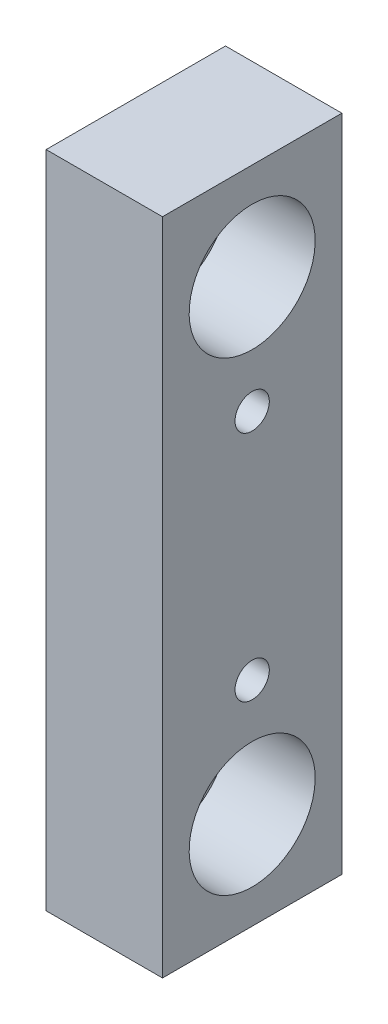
ISO-10303-21;
HEADER;
FILE_DESCRIPTION(('STEP AP214'),'2;1');
FILE_NAME('part.step','',(''),(''),'','','');
FILE_SCHEMA(('AUTOMOTIVE_DESIGN { 1 0 10303 214 1 1 1 1 }'));
ENDSEC;
DATA;
#1=APPLICATION_CONTEXT('core data for automotive mechanical design processes');
#2=APPLICATION_PROTOCOL_DEFINITION('international standard','automotive_design',2000,#1);
#3=PRODUCT_CONTEXT('',#1,'mechanical');
#4=PRODUCT('Part','Part','',(#3));
#5=PRODUCT_RELATED_PRODUCT_CATEGORY('part','',(#4));
#6=PRODUCT_DEFINITION_FORMATION('','',#4);
#7=PRODUCT_DEFINITION_CONTEXT('part definition',#1,'design');
#8=PRODUCT_DEFINITION('design','',#6,#7);
#9=PRODUCT_DEFINITION_SHAPE('','',#8);
#10=(LENGTH_UNIT() NAMED_UNIT(*) SI_UNIT(.MILLI.,.METRE.));
#11=(NAMED_UNIT(*) PLANE_ANGLE_UNIT() SI_UNIT($,.RADIAN.));
#12=(NAMED_UNIT(*) SI_UNIT($,.STERADIAN.) SOLID_ANGLE_UNIT());
#13=UNCERTAINTY_MEASURE_WITH_UNIT(LENGTH_MEASURE(1.E-05),#10,'distance_accuracy_value','');
#14=(GEOMETRIC_REPRESENTATION_CONTEXT(3) GLOBAL_UNCERTAINTY_ASSIGNED_CONTEXT((#13)) GLOBAL_UNIT_ASSIGNED_CONTEXT((#10,
#11,#12)) REPRESENTATION_CONTEXT('',''));
#15=CARTESIAN_POINT('',(0.,0.,0.));
#16=DIRECTION('',(0.,0.,1.));
#17=DIRECTION('',(1.,0.,0.));
#18=AXIS2_PLACEMENT_3D('',#15,#16,#17);
#19=CARTESIAN_POINT('',(-60.3249999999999,-38.1,4.36562500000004));
#20=DIRECTION('',(-1.,0.,0.));
#21=DIRECTION('',(0.,-1.,0.));
#22=AXIS2_PLACEMENT_3D('',#19,#20,#21);
#23=CYLINDRICAL_SURFACE('',#22,5.1562);
#24=CARTESIAN_POINT('',(-101.6,-38.1,4.36562500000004));
#25=DIRECTION('',(-1.,0.,0.));
#26=DIRECTION('',(0.,-1.,0.));
#27=AXIS2_PLACEMENT_3D('',#24,#25,#26);
#28=CIRCLE('',#27,5.1562);
#29=CARTESIAN_POINT('',(-101.6,-43.2562,4.36562500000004));
#30=VERTEX_POINT('',#29);
#31=EDGE_CURVE('E12',#30,#30,#28,.T.);
#32=ORIENTED_EDGE('',*,*,#31,.T.);
#33=EDGE_LOOP('',(#32));
#34=FACE_BOUND('',#33,.T.);
#35=CARTESIAN_POINT('',(-96.8375,-38.1,4.36562500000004));
#36=DIRECTION('',(1.,0.,0.));
#37=DIRECTION('',(0.,1.,0.));
#38=AXIS2_PLACEMENT_3D('',#35,#36,#37);
#39=CIRCLE('',#38,5.1562);
#40=CARTESIAN_POINT('',(-96.8375,-32.9438,4.36562500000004));
#41=VERTEX_POINT('',#40);
#42=EDGE_CURVE('E45',#41,#41,#39,.F.);
#43=ORIENTED_EDGE('',*,*,#42,.F.);
#44=EDGE_LOOP('',(#43));
#45=FACE_BOUND('',#44,.T.);
#46=ADVANCED_FACE('F41',(#34,#45),#23,.F.);
#47=CARTESIAN_POINT('',(-60.325,38.1,4.36562500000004));
#48=DIRECTION('',(-1.,0.,0.));
#49=DIRECTION('',(0.,-1.,0.));
#50=AXIS2_PLACEMENT_3D('',#47,#48,#49);
#51=CYLINDRICAL_SURFACE('',#50,5.1562);
#52=CARTESIAN_POINT('',(-101.6,38.1,4.36562500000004));
#53=DIRECTION('',(-1.,0.,0.));
#54=DIRECTION('',(0.,-1.,0.));
#55=AXIS2_PLACEMENT_3D('',#52,#53,#54);
#56=CIRCLE('',#55,5.1562);
#57=CARTESIAN_POINT('',(-101.6,32.9438,4.36562500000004));
#58=VERTEX_POINT('',#57);
#59=EDGE_CURVE('E50',#58,#58,#56,.T.);
#60=ORIENTED_EDGE('',*,*,#59,.T.);
#61=EDGE_LOOP('',(#60));
#62=FACE_BOUND('',#61,.T.);
#63=CARTESIAN_POINT('',(-96.8375,38.1,4.36562500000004));
#64=DIRECTION('',(1.,0.,0.));
#65=DIRECTION('',(0.,1.,0.));
#66=AXIS2_PLACEMENT_3D('',#63,#64,#65);
#67=CIRCLE('',#66,5.1562);
#68=CARTESIAN_POINT('',(-96.8375,43.2562,4.36562500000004));
#69=VERTEX_POINT('',#68);
#70=EDGE_CURVE('E136',#69,#69,#67,.F.);
#71=ORIENTED_EDGE('',*,*,#70,.F.);
#72=EDGE_LOOP('',(#71));
#73=FACE_BOUND('',#72,.T.);
#74=ADVANCED_FACE('F143',(#62,#73),#51,.F.);
#75=CARTESIAN_POINT('',(-101.6,50.7999999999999,-19.05));
#76=DIRECTION('',(-1.,0.,0.));
#77=DIRECTION('',(0.,-1.,0.));
#78=AXIS2_PLACEMENT_3D('',#75,#76,#77);
#79=PLANE('',#78);
#80=CARTESIAN_POINT('',(-101.6,19.05,4.36562500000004));
#81=DIRECTION('',(-1.,0.,0.));
#82=DIRECTION('',(0.,0.,1.));
#83=AXIS2_PLACEMENT_3D('',#80,#81,#82);
#84=CIRCLE('',#83,4.7625);
#85=CARTESIAN_POINT('',(-101.6,19.05,9.12812500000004));
#86=VERTEX_POINT('',#85);
#87=EDGE_CURVE('E216',#86,#86,#84,.T.);
#88=ORIENTED_EDGE('',*,*,#87,.F.);
#89=EDGE_LOOP('',(#88));
#90=FACE_BOUND('',#89,.T.);
#91=CARTESIAN_POINT('',(-101.6,-19.05,4.36562500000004));
#92=DIRECTION('',(-1.,0.,0.));
#93=DIRECTION('',(0.,0.,1.));
#94=AXIS2_PLACEMENT_3D('',#91,#92,#93);
#95=CIRCLE('',#94,4.7625);
#96=CARTESIAN_POINT('',(-101.6,-19.05,9.12812500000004));
#97=VERTEX_POINT('',#96);
#98=EDGE_CURVE('E226',#97,#97,#95,.T.);
#99=ORIENTED_EDGE('',*,*,#98,.F.);
#100=EDGE_LOOP('',(#99));
#101=FACE_BOUND('',#100,.T.);
#102=ORIENTED_EDGE('',*,*,#59,.F.);
#103=EDGE_LOOP('',(#102));
#104=FACE_BOUND('',#103,.T.);
#105=ORIENTED_EDGE('',*,*,#31,.F.);
#106=EDGE_LOOP('',(#105));
#107=FACE_BOUND('',#106,.T.);
#108=DIRECTION('',(0.,-1.,0.));
#109=VECTOR('',#108,1.);
#110=CARTESIAN_POINT('',(-101.6,50.7999999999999,19.05));
#111=LINE('',#110,#109);
#112=CARTESIAN_POINT('',(-101.6,53.9749999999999,19.05));
#113=VERTEX_POINT('',#112);
#114=CARTESIAN_POINT('',(-101.6,-53.9750000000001,19.05));
#115=VERTEX_POINT('',#114);
#116=EDGE_CURVE('E83',#113,#115,#111,.T.);
#117=ORIENTED_EDGE('',*,*,#116,.F.);
#118=DIRECTION('',(0.,0.,1.));
#119=VECTOR('',#118,1.);
#120=CARTESIAN_POINT('',(-101.6,53.975,-10.3187499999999));
#121=LINE('',#120,#119);
#122=CARTESIAN_POINT('',(-101.6,53.975,-10.3187499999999));
#123=VERTEX_POINT('',#122);
#124=EDGE_CURVE('E117',#123,#113,#121,.T.);
#125=ORIENTED_EDGE('',*,*,#124,.F.);
#126=DIRECTION('',(0.,1.,0.));
#127=VECTOR('',#126,1.);
#128=CARTESIAN_POINT('',(-101.6,-50.8,-10.31875));
#129=LINE('',#128,#127);
#130=CARTESIAN_POINT('',(-101.6,-53.975,-10.31875));
#131=VERTEX_POINT('',#130);
#132=EDGE_CURVE('E96',#131,#123,#129,.T.);
#133=ORIENTED_EDGE('',*,*,#132,.F.);
#134=DIRECTION('',(0.,0.,-1.));
#135=VECTOR('',#134,1.);
#136=CARTESIAN_POINT('',(-101.6,-53.9750000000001,19.05));
#137=LINE('',#136,#135);
#138=EDGE_CURVE('E95',#115,#131,#137,.T.);
#139=ORIENTED_EDGE('',*,*,#138,.F.);
#140=EDGE_LOOP('',(#117,#125,#133,#139));
#141=FACE_BOUND('',#140,.T.);
#142=ADVANCED_FACE('F43',(#90,#101,#104,#107,#141),#79,.T.);
#143=CARTESIAN_POINT('',(-96.8375,38.1,4.36562500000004));
#144=DIRECTION('',(1.,0.,0.));
#145=DIRECTION('',(0.,1.,0.));
#146=AXIS2_PLACEMENT_3D('',#143,#144,#145);
#147=PLANE('',#146);
#148=CARTESIAN_POINT('',(-96.8375,38.1,4.36562500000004));
#149=DIRECTION('',(1.,0.,0.));
#150=DIRECTION('',(0.,1.,0.));
#151=AXIS2_PLACEMENT_3D('',#148,#149,#150);
#152=CIRCLE('',#151,10.31875);
#153=CARTESIAN_POINT('',(-96.8375,48.41875,4.36562500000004));
#154=VERTEX_POINT('',#153);
#155=EDGE_CURVE('E133',#154,#154,#152,.T.);
#156=ORIENTED_EDGE('',*,*,#155,.T.);
#157=EDGE_LOOP('',(#156));
#158=FACE_BOUND('',#157,.T.);
#159=ORIENTED_EDGE('',*,*,#70,.T.);
#160=EDGE_LOOP('',(#159));
#161=FACE_BOUND('',#160,.T.);
#162=ADVANCED_FACE('F141',(#158,#161),#147,.T.);
#163=CARTESIAN_POINT('',(-96.8375,38.1,4.36562500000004));
#164=DIRECTION('',(1.,0.,0.));
#165=DIRECTION('',(0.,1.,0.));
#166=AXIS2_PLACEMENT_3D('',#163,#164,#165);
#167=CYLINDRICAL_SURFACE('',#166,10.31875);
#168=ORIENTED_EDGE('',*,*,#155,.F.);
#169=EDGE_LOOP('',(#168));
#170=FACE_BOUND('',#169,.T.);
#171=CARTESIAN_POINT('',(-82.55,38.1,4.36562500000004));
#172=DIRECTION('',(1.,0.,0.));
#173=DIRECTION('',(0.,1.,0.));
#174=AXIS2_PLACEMENT_3D('',#171,#172,#173);
#175=CIRCLE('',#174,10.31875);
#176=CARTESIAN_POINT('',(-82.55,48.41875,4.36562500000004));
#177=VERTEX_POINT('',#176);
#178=EDGE_CURVE('E127',#177,#177,#175,.T.);
#179=ORIENTED_EDGE('',*,*,#178,.T.);
#180=EDGE_LOOP('',(#179));
#181=FACE_BOUND('',#180,.T.);
#182=ADVANCED_FACE('F154',(#170,#181),#167,.F.);
#183=CARTESIAN_POINT('',(-96.8375,-38.1,4.36562500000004));
#184=DIRECTION('',(1.,0.,0.));
#185=DIRECTION('',(0.,1.,0.));
#186=AXIS2_PLACEMENT_3D('',#183,#184,#185);
#187=PLANE('',#186);
#188=CARTESIAN_POINT('',(-96.8375,-38.1,4.36562500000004));
#189=DIRECTION('',(1.,0.,0.));
#190=DIRECTION('',(0.,1.,0.));
#191=AXIS2_PLACEMENT_3D('',#188,#189,#190);
#192=CIRCLE('',#191,10.31875);
#193=CARTESIAN_POINT('',(-96.8375,-27.78125,4.36562500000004));
#194=VERTEX_POINT('',#193);
#195=EDGE_CURVE('E130',#194,#194,#192,.T.);
#196=ORIENTED_EDGE('',*,*,#195,.T.);
#197=EDGE_LOOP('',(#196));
#198=FACE_BOUND('',#197,.T.);
#199=ORIENTED_EDGE('',*,*,#42,.T.);
#200=EDGE_LOOP('',(#199));
#201=FACE_BOUND('',#200,.T.);
#202=ADVANCED_FACE('F157',(#198,#201),#187,.T.);
#203=CARTESIAN_POINT('',(-96.8375,-38.1,4.36562500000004));
#204=DIRECTION('',(1.,0.,0.));
#205=DIRECTION('',(0.,1.,0.));
#206=AXIS2_PLACEMENT_3D('',#203,#204,#205);
#207=CYLINDRICAL_SURFACE('',#206,10.31875);
#208=ORIENTED_EDGE('',*,*,#195,.F.);
#209=EDGE_LOOP('',(#208));
#210=FACE_BOUND('',#209,.T.);
#211=CARTESIAN_POINT('',(-82.55,-38.1,4.36562500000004));
#212=DIRECTION('',(1.,0.,0.));
#213=DIRECTION('',(0.,1.,0.));
#214=AXIS2_PLACEMENT_3D('',#211,#212,#213);
#215=CIRCLE('',#214,10.31875);
#216=CARTESIAN_POINT('',(-82.55,-27.78125,4.36562500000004));
#217=VERTEX_POINT('',#216);
#218=EDGE_CURVE('E124',#217,#217,#215,.T.);
#219=ORIENTED_EDGE('',*,*,#218,.T.);
#220=EDGE_LOOP('',(#219));
#221=FACE_BOUND('',#220,.T.);
#222=ADVANCED_FACE('F162',(#210,#221),#207,.F.);
#223=CARTESIAN_POINT('',(-82.55,-50.8,15.875));
#224=DIRECTION('',(1.,0.,0.));
#225=DIRECTION('',(0.,1.,0.));
#226=AXIS2_PLACEMENT_3D('',#223,#224,#225);
#227=PLANE('',#226);
#228=CARTESIAN_POINT('',(-82.55,19.05,4.36562500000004));
#229=DIRECTION('',(-1.,0.,0.));
#230=DIRECTION('',(0.,0.,1.));
#231=AXIS2_PLACEMENT_3D('',#228,#229,#230);
#232=CIRCLE('',#231,2.8067);
#233=CARTESIAN_POINT('',(-82.55,19.05,7.17232500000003));
#234=VERTEX_POINT('',#233);
#235=EDGE_CURVE('E223',#234,#234,#232,.T.);
#236=ORIENTED_EDGE('',*,*,#235,.T.);
#237=EDGE_LOOP('',(#236));
#238=FACE_BOUND('',#237,.T.);
#239=CARTESIAN_POINT('',(-82.55,-19.05,4.36562500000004));
#240=DIRECTION('',(-1.,0.,0.));
#241=DIRECTION('',(0.,0.,1.));
#242=AXIS2_PLACEMENT_3D('',#239,#240,#241);
#243=CIRCLE('',#242,2.8067);
#244=CARTESIAN_POINT('',(-82.55,-19.05,7.17232500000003));
#245=VERTEX_POINT('',#244);
#246=EDGE_CURVE('E105',#245,#245,#243,.T.);
#247=ORIENTED_EDGE('',*,*,#246,.T.);
#248=EDGE_LOOP('',(#247));
#249=FACE_BOUND('',#248,.T.);
#250=ORIENTED_EDGE('',*,*,#178,.F.);
#251=EDGE_LOOP('',(#250));
#252=FACE_BOUND('',#251,.T.);
#253=DIRECTION('',(0.,-1.,0.));
#254=VECTOR('',#253,1.);
#255=CARTESIAN_POINT('',(-82.55,50.8,-10.3187499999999));
#256=LINE('',#255,#254);
#257=CARTESIAN_POINT('',(-82.55,53.975,-10.3187499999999));
#258=VERTEX_POINT('',#257);
#259=CARTESIAN_POINT('',(-82.55,-53.975,-10.31875));
#260=VERTEX_POINT('',#259);
#261=EDGE_CURVE('E58',#258,#260,#256,.T.);
#262=ORIENTED_EDGE('',*,*,#261,.F.);
#263=DIRECTION('',(0.,0.,-1.));
#264=VECTOR('',#263,1.);
#265=CARTESIAN_POINT('',(-82.55,53.975,19.05));
#266=LINE('',#265,#264);
#267=CARTESIAN_POINT('',(-82.55,53.975,19.05));
#268=VERTEX_POINT('',#267);
#269=EDGE_CURVE('E92',#268,#258,#266,.T.);
#270=ORIENTED_EDGE('',*,*,#269,.F.);
#271=DIRECTION('',(0.,1.,0.));
#272=VECTOR('',#271,1.);
#273=CARTESIAN_POINT('',(-82.55,-50.8,19.05));
#274=LINE('',#273,#272);
#275=CARTESIAN_POINT('',(-82.55,-53.975,19.05));
#276=VERTEX_POINT('',#275);
#277=EDGE_CURVE('E66',#276,#268,#274,.T.);
#278=ORIENTED_EDGE('',*,*,#277,.F.);
#279=DIRECTION('',(0.,0.,1.));
#280=VECTOR('',#279,1.);
#281=CARTESIAN_POINT('',(-82.55,-53.975,-10.31875));
#282=LINE('',#281,#280);
#283=EDGE_CURVE('E104',#260,#276,#282,.T.);
#284=ORIENTED_EDGE('',*,*,#283,.F.);
#285=EDGE_LOOP('',(#262,#270,#278,#284));
#286=FACE_BOUND('',#285,.T.);
#287=ORIENTED_EDGE('',*,*,#218,.F.);
#288=EDGE_LOOP('',(#287));
#289=FACE_BOUND('',#288,.T.);
#290=ADVANCED_FACE('F165',(#238,#249,#252,#286,#289),#227,.T.);
#291=CARTESIAN_POINT('',(-101.6,50.8,-10.3187499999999));
#292=DIRECTION('',(0.,0.,-1.));
#293=DIRECTION('',(-1.,0.,0.));
#294=AXIS2_PLACEMENT_3D('',#291,#292,#293);
#295=PLANE('',#294);
#296=ORIENTED_EDGE('',*,*,#132,.T.);
#297=DIRECTION('',(-1.,0.,0.));
#298=VECTOR('',#297,1.);
#299=CARTESIAN_POINT('',(-82.55,53.975,-10.3187499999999));
#300=LINE('',#299,#298);
#301=EDGE_CURVE('E114',#258,#123,#300,.T.);
#302=ORIENTED_EDGE('',*,*,#301,.F.);
#303=ORIENTED_EDGE('',*,*,#261,.T.);
#304=DIRECTION('',(1.,0.,0.));
#305=VECTOR('',#304,1.);
#306=CARTESIAN_POINT('',(-101.6,-53.975,-10.31875));
#307=LINE('',#306,#305);
#308=EDGE_CURVE('E100',#131,#260,#307,.T.);
#309=ORIENTED_EDGE('',*,*,#308,.F.);
#310=EDGE_LOOP('',(#296,#302,#303,#309));
#311=FACE_BOUND('',#310,.T.);
#312=ADVANCED_FACE('F172',(#311),#295,.T.);
#313=CARTESIAN_POINT('',(-101.6,-50.8000000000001,19.05));
#314=DIRECTION('',(0.,0.,1.));
#315=DIRECTION('',(1.,0.,0.));
#316=AXIS2_PLACEMENT_3D('',#313,#314,#315);
#317=PLANE('',#316);
#318=ORIENTED_EDGE('',*,*,#116,.T.);
#319=DIRECTION('',(-1.,0.,0.));
#320=VECTOR('',#319,1.);
#321=CARTESIAN_POINT('',(-82.55,-53.975,19.05));
#322=LINE('',#321,#320);
#323=EDGE_CURVE('E87',#276,#115,#322,.T.);
#324=ORIENTED_EDGE('',*,*,#323,.F.);
#325=ORIENTED_EDGE('',*,*,#277,.T.);
#326=DIRECTION('',(1.,0.,0.));
#327=VECTOR('',#326,1.);
#328=CARTESIAN_POINT('',(-101.6,53.9749999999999,19.05));
#329=LINE('',#328,#327);
#330=EDGE_CURVE('E88',#113,#268,#329,.T.);
#331=ORIENTED_EDGE('',*,*,#330,.F.);
#332=EDGE_LOOP('',(#318,#324,#325,#331));
#333=FACE_BOUND('',#332,.T.);
#334=ADVANCED_FACE('F85',(#333),#317,.T.);
#335=CARTESIAN_POINT('',(-101.6,53.975,-10.3187499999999));
#336=DIRECTION('',(0.,1.,0.));
#337=DIRECTION('',(0.,0.,1.));
#338=AXIS2_PLACEMENT_3D('',#335,#336,#337);
#339=PLANE('',#338);
#340=ORIENTED_EDGE('',*,*,#301,.T.);
#341=ORIENTED_EDGE('',*,*,#124,.T.);
#342=ORIENTED_EDGE('',*,*,#330,.T.);
#343=ORIENTED_EDGE('',*,*,#269,.T.);
#344=EDGE_LOOP('',(#340,#341,#342,#343));
#345=FACE_BOUND('',#344,.T.);
#346=ADVANCED_FACE('F179',(#345),#339,.T.);
#347=CARTESIAN_POINT('',(-101.6,-53.9750000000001,19.05));
#348=DIRECTION('',(0.,-1.,0.));
#349=DIRECTION('',(1.,0.,0.));
#350=AXIS2_PLACEMENT_3D('',#347,#348,#349);
#351=PLANE('',#350);
#352=ORIENTED_EDGE('',*,*,#323,.T.);
#353=ORIENTED_EDGE('',*,*,#138,.T.);
#354=ORIENTED_EDGE('',*,*,#308,.T.);
#355=ORIENTED_EDGE('',*,*,#283,.T.);
#356=EDGE_LOOP('',(#352,#353,#354,#355));
#357=FACE_BOUND('',#356,.T.);
#358=ADVANCED_FACE('F103',(#357),#351,.T.);
#359=CARTESIAN_POINT('',(-101.6,-19.05,4.36562500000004));
#360=DIRECTION('',(-1.,0.,0.));
#361=DIRECTION('',(0.,0.,1.));
#362=AXIS2_PLACEMENT_3D('',#359,#360,#361);
#363=CYLINDRICAL_SURFACE('',#362,2.8067);
#364=ORIENTED_EDGE('',*,*,#246,.F.);
#365=EDGE_LOOP('',(#364));
#366=FACE_BOUND('',#365,.T.);
#367=CARTESIAN_POINT('',(-88.9,-19.05,4.36562500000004));
#368=DIRECTION('',(-1.,0.,0.));
#369=DIRECTION('',(0.,0.,1.));
#370=AXIS2_PLACEMENT_3D('',#367,#368,#369);
#371=CIRCLE('',#370,2.8067);
#372=CARTESIAN_POINT('',(-88.9,-19.05,7.17232500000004));
#373=VERTEX_POINT('',#372);
#374=EDGE_CURVE('E108',#373,#373,#371,.T.);
#375=ORIENTED_EDGE('',*,*,#374,.T.);
#376=EDGE_LOOP('',(#375));
#377=FACE_BOUND('',#376,.T.);
#378=ADVANCED_FACE('F185',(#366,#377),#363,.F.);
#379=CARTESIAN_POINT('',(-88.9,-16.2433,4.36562500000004));
#380=DIRECTION('',(1.,0.,0.));
#381=DIRECTION('',(0.,0.,-1.));
#382=AXIS2_PLACEMENT_3D('',#379,#380,#381);
#383=PLANE('',#382);
#384=ORIENTED_EDGE('',*,*,#374,.F.);
#385=EDGE_LOOP('',(#384));
#386=FACE_BOUND('',#385,.T.);
#387=CARTESIAN_POINT('',(-88.9,-19.05,4.36562500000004));
#388=DIRECTION('',(-1.,0.,0.));
#389=DIRECTION('',(0.,0.,1.));
#390=AXIS2_PLACEMENT_3D('',#387,#388,#389);
#391=CIRCLE('',#390,4.7625);
#392=CARTESIAN_POINT('',(-88.9,-19.05,9.12812500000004));
#393=VERTEX_POINT('',#392);
#394=EDGE_CURVE('E229',#393,#393,#391,.T.);
#395=ORIENTED_EDGE('',*,*,#394,.T.);
#396=EDGE_LOOP('',(#395));
#397=FACE_BOUND('',#396,.T.);
#398=ADVANCED_FACE('F188',(#386,#397),#383,.F.);
#399=CARTESIAN_POINT('',(-101.6,-19.05,4.36562500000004));
#400=DIRECTION('',(-1.,0.,0.));
#401=DIRECTION('',(0.,0.,1.));
#402=AXIS2_PLACEMENT_3D('',#399,#400,#401);
#403=CYLINDRICAL_SURFACE('',#402,4.7625);
#404=ORIENTED_EDGE('',*,*,#394,.F.);
#405=EDGE_LOOP('',(#404));
#406=FACE_BOUND('',#405,.T.);
#407=ORIENTED_EDGE('',*,*,#98,.T.);
#408=EDGE_LOOP('',(#407));
#409=FACE_BOUND('',#408,.T.);
#410=ADVANCED_FACE('F192',(#406,#409),#403,.F.);
#411=CARTESIAN_POINT('',(-101.6,19.05,4.36562500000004));
#412=DIRECTION('',(-1.,0.,0.));
#413=DIRECTION('',(0.,0.,1.));
#414=AXIS2_PLACEMENT_3D('',#411,#412,#413);
#415=CYLINDRICAL_SURFACE('',#414,2.8067);
#416=ORIENTED_EDGE('',*,*,#235,.F.);
#417=EDGE_LOOP('',(#416));
#418=FACE_BOUND('',#417,.T.);
#419=CARTESIAN_POINT('',(-88.9,19.05,4.36562500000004));
#420=DIRECTION('',(-1.,0.,0.));
#421=DIRECTION('',(0.,0.,1.));
#422=AXIS2_PLACEMENT_3D('',#419,#420,#421);
#423=CIRCLE('',#422,2.8067);
#424=CARTESIAN_POINT('',(-88.9,19.05,7.17232500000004));
#425=VERTEX_POINT('',#424);
#426=EDGE_CURVE('E218',#425,#425,#423,.T.);
#427=ORIENTED_EDGE('',*,*,#426,.T.);
#428=EDGE_LOOP('',(#427));
#429=FACE_BOUND('',#428,.T.);
#430=ADVANCED_FACE('F196',(#418,#429),#415,.F.);
#431=CARTESIAN_POINT('',(-88.9,21.8567,4.36562500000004));
#432=DIRECTION('',(1.,0.,0.));
#433=DIRECTION('',(0.,0.,-1.));
#434=AXIS2_PLACEMENT_3D('',#431,#432,#433);
#435=PLANE('',#434);
#436=ORIENTED_EDGE('',*,*,#426,.F.);
#437=EDGE_LOOP('',(#436));
#438=FACE_BOUND('',#437,.T.);
#439=CARTESIAN_POINT('',(-88.9,19.05,4.36562500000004));
#440=DIRECTION('',(-1.,0.,0.));
#441=DIRECTION('',(0.,0.,1.));
#442=AXIS2_PLACEMENT_3D('',#439,#440,#441);
#443=CIRCLE('',#442,4.7625);
#444=CARTESIAN_POINT('',(-88.9,19.05,9.12812500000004));
#445=VERTEX_POINT('',#444);
#446=EDGE_CURVE('E213',#445,#445,#443,.T.);
#447=ORIENTED_EDGE('',*,*,#446,.T.);
#448=EDGE_LOOP('',(#447));
#449=FACE_BOUND('',#448,.T.);
#450=ADVANCED_FACE('F200',(#438,#449),#435,.F.);
#451=CARTESIAN_POINT('',(-101.6,19.05,4.36562500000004));
#452=DIRECTION('',(-1.,0.,0.));
#453=DIRECTION('',(0.,0.,1.));
#454=AXIS2_PLACEMENT_3D('',#451,#452,#453);
#455=CYLINDRICAL_SURFACE('',#454,4.7625);
#456=ORIENTED_EDGE('',*,*,#446,.F.);
#457=EDGE_LOOP('',(#456));
#458=FACE_BOUND('',#457,.T.);
#459=ORIENTED_EDGE('',*,*,#87,.T.);
#460=EDGE_LOOP('',(#459));
#461=FACE_BOUND('',#460,.T.);
#462=ADVANCED_FACE('F204',(#458,#461),#455,.F.);
#463=CLOSED_SHELL('',(#46,#74,#142,#162,#182,#202,#222,#290,#312,#334,#346,#358,#378,#398,#410,
#430,#450,#462));
#464=MANIFOLD_SOLID_BREP('B2',#463);
#465=ADVANCED_BREP_SHAPE_REPRESENTATION('',(#18,#464),#14);
#466=SHAPE_DEFINITION_REPRESENTATION(#9,#465);
ENDSEC;
END-ISO-10303-21;
